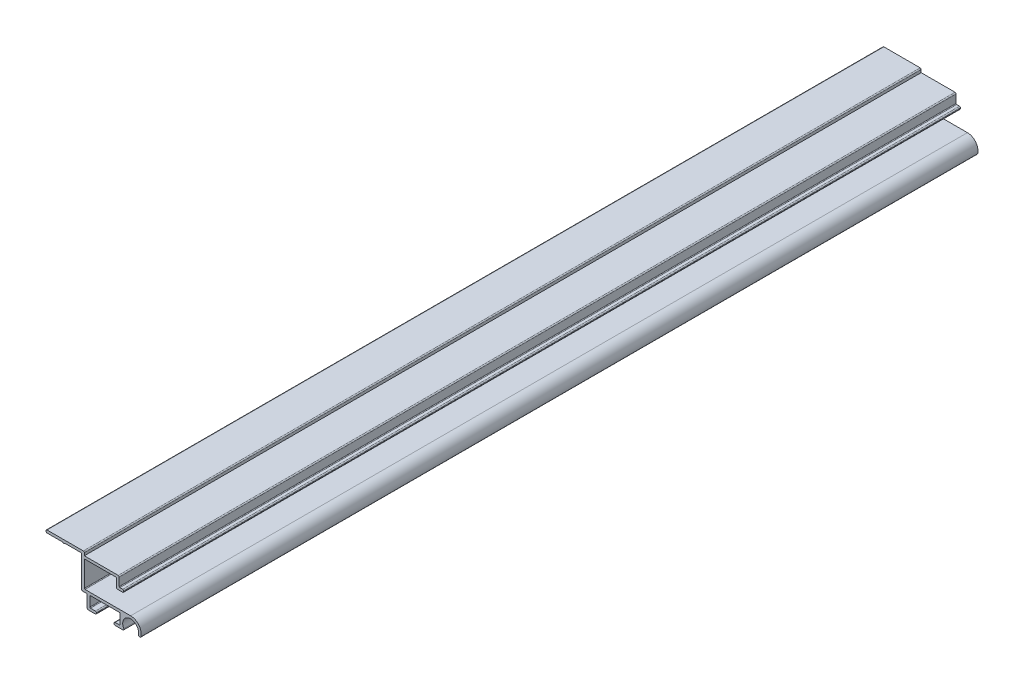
from build123d import *

# Parameters (mm, degrees)
BOSS_EXTRU_1_DEPTH = 316.5


with BuildPart() as part:
    # Esquisse1 → Boss.-Extru.1 (new body)
    with BuildSketch(Plane.XY):
        with BuildLine():
            Line((-7.19, 0), (-13.1, 0))
            ThreePointArc((-13.1, 0), (-13.382842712, 0.117157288), (-13.5, 0.4))
            Line((-13.5, 0.4), (-13.5, 0.6))
            ThreePointArc((-13.5, 0.6), (-13.382842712, 0.882842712), (-13.1, 1))
            Line((-13.1, 1), (0.6, 1))
            ThreePointArc((0.6, 1), (0.882842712, 0.882842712), (1, 0.6))
            Line((1, 0.6), (1, -0.4))
            Line((1, -0.4), (13.8, -0.4))
            ThreePointArc((13.8, -0.4), (14.082842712, -0.517157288), (14.2, -0.8))
            Line((14.2, -0.8), (14.2, -3.85))
            ThreePointArc((14.2, -3.85), (14.273223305, -4.026776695), (14.45, -4.1))
            Line((14.45, -4.1), (15.5, -4.1))
            ThreePointArc((15.5, -4.1), (15.782842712, -4.217157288), (15.9, -4.5))
            Line((15.9, -4.5), (15.9, -4.7))
            ThreePointArc((15.9, -4.7), (15.782842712, -4.982842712), (15.5, -5.1))
            Line((15.5, -5.1), (13.6, -5.1))
            ThreePointArc((13.6, -5.1), (13.317157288, -4.982842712), (13.2, -4.7))
            Line((13.2, -4.7), (13.2, -1.65))
            ThreePointArc((13.2, -1.65), (13.126776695, -1.473223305), (12.95, -1.4))
            Line((12.95, -1.4), (1.25, -1.4))
            ThreePointArc((1.25, -1.4), (1.073223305, -1.473223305), (1, -1.65))
            Line((1, -1.65), (1, -11.05))
            ThreePointArc((1, -11.05), (1.073223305, -11.226776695), (1.25, -11.3))
            Line((1.25, -11.3), (18.5, -11.3))
            ThreePointArc((18.5, -11.3), (21.643872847, -12.826932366), (22.387505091, -16.24196824))
            ThreePointArc((22.387505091, -16.24196824), (22.187711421, -16.50032682), (21.861946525, -16.523648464))
            Line((21.861946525, -16.523648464), (21.672939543, -16.454855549))
            ThreePointArc((21.672939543, -16.454855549), (21.457815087, -16.269092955), (21.420386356, -15.987338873))
            ThreePointArc((21.420386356, -15.987338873), (18.06291077, -12.331828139), (15.901719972, -16.800010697))
            ThreePointArc((15.901719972, -16.800010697), (15.901710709, -17.200005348), (15.555303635, -17.4))
            Line((15.555303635, -17.4), (12.657316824, -17.4))
            ThreePointArc((12.657316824, -17.4), (12.374474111, -17.282842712), (12.257316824, -17))
            Line((12.257316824, -17), (12.257316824, -16.8))
            ThreePointArc((12.257316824, -16.8), (12.374474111, -16.517157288), (12.657316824, -16.4))
            Line((12.657316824, -16.4), (14.25, -16.4))
            ThreePointArc((14.25, -16.4), (14.426776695, -16.326776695), (14.5, -16.15))
            Line((14.5, -16.15), (14.5, -12.55))
            ThreePointArc((14.5, -12.55), (14.426776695, -12.373223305), (14.25, -12.3))
            Line((14.25, -12.3), (3.307316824, -12.3))
            ThreePointArc((3.307316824, -12.3), (3.130540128, -12.373223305), (3.057316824, -12.55))
            Line((3.057316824, -12.55), (3.057316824, -16.15))
            ThreePointArc((3.057316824, -16.15), (3.130540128, -16.326776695), (3.307316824, -16.4))
            Line((3.307316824, -16.4), (5.157316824, -16.4))
            ThreePointArc((5.157316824, -16.4), (5.440159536, -16.517157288), (5.557316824, -16.8))
            Line((5.557316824, -16.8), (5.557316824, -17))
            ThreePointArc((5.557316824, -17), (5.440159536, -17.282842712), (5.157316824, -17.4))
            Line((5.157316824, -17.4), (2.457316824, -17.4))
            ThreePointArc((2.457316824, -17.4), (2.174474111, -17.282842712), (2.057316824, -17))
            Line((2.057316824, -17), (2.057316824, -12.55))
            ThreePointArc((2.057316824, -12.55), (1.984093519, -12.373223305), (1.807316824, -12.3))
            Line((1.807316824, -12.3), (1, -12.3))
            Line((1, -12.3), (0.4, -12.3))
            ThreePointArc((0.4, -12.3), (0.117157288, -12.182842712), (0, -11.9))
            Line((0, -11.9), (0, -8.040048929))
            Line((0, -8.040048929), (0, -7.092148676))
            Line((0, -7.092148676), (0, -0.25))
            ThreePointArc((0, -0.25), (-0.073223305, -0.073223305), (-0.25, 0))
            Line((-0.25, 0), (-6.31, 0))
            ThreePointArc((-6.31, 0), (-6.75, -0.22), (-7.19, 0))
        make_face()
    extrude(amount=BOSS_EXTRU_1_DEPTH)


solid = part.part
